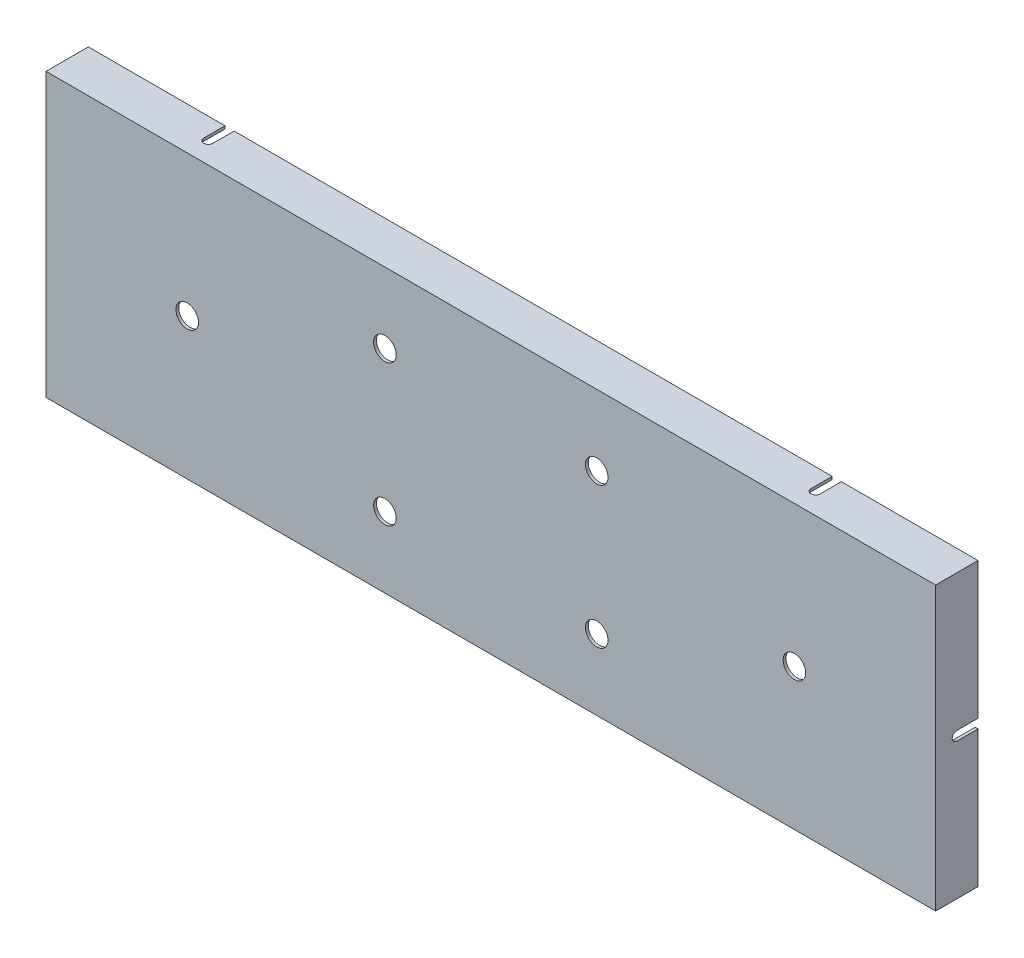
from build123d import *

# Parameters (mm, degrees)
SKETCH_1_W          = 630
SKETCH_1_H          = 200
EXTRUDE_1_DEPTH     = 30
SHELL_2_T           = -2
CUT_EXTRUDE_1_REACH = 663.665
SKETCH_4_R          = 8
CUT_EXTRUDE_2_DEPTH = 662.664567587
CUT_EXTRUDE_3_DEPTH = 662.664567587


with BuildPart() as part:
    # Sketch 1 → Extrude 1 (new body)
    with BuildSketch(Plane.XY):
        with Locations((315, -100)):
            Rectangle(SKETCH_1_W, SKETCH_1_H)
    extrude(amount=EXTRUDE_1_DEPTH)

    # Shell 2
    shell_2_openings = [part.faces().sort_by_distance(p)[0] for p in [
        (315, -100, 0),
    ]]
    offset(amount=SHELL_2_T, openings=shell_2_openings, kind=Kind.INTERSECTION)

    # Sketch 4 → Cut-Extrude 1 (cut, up to next)
    with BuildSketch(Plane.XY.offset(30), mode=Mode.PRIVATE) as cut_extrude_1_sk1:
        with Locations((530, -100)):
            Circle(SKETCH_4_R)
    cut_extrude_1_tool1 = extrude(cut_extrude_1_sk1.sketch, amount=-CUT_EXTRUDE_1_REACH, mode=Mode.PRIVATE) & part.part
    # Sketch 4 → Cut-Extrude 1 (cut, up to next)
    with BuildSketch(Plane.XY.offset(30), mode=Mode.PRIVATE) as cut_extrude_1_sk2:
        with Locations((100, -100)):
            Circle(SKETCH_4_R)
    cut_extrude_1_tool2 = extrude(cut_extrude_1_sk2.sketch, amount=-CUT_EXTRUDE_1_REACH, mode=Mode.PRIVATE) & part.part
    # Sketch 4 → Cut-Extrude 1 (cut, up to next)
    with BuildSketch(Plane.XY.offset(30), mode=Mode.PRIVATE) as cut_extrude_1_sk3:
        with Locations((240, -50)):
            Circle(SKETCH_4_R)
    cut_extrude_1_tool3 = extrude(cut_extrude_1_sk3.sketch, amount=-CUT_EXTRUDE_1_REACH, mode=Mode.PRIVATE) & part.part
    # Sketch 4 → Cut-Extrude 1 (cut, up to next)
    with BuildSketch(Plane.XY.offset(30), mode=Mode.PRIVATE) as cut_extrude_1_sk4:
        with Locations((390, -50)):
            Circle(SKETCH_4_R)
    cut_extrude_1_tool4 = extrude(cut_extrude_1_sk4.sketch, amount=-CUT_EXTRUDE_1_REACH, mode=Mode.PRIVATE) & part.part
    # Sketch 4 → Cut-Extrude 1 (cut, up to next)
    with BuildSketch(Plane.XY.offset(30), mode=Mode.PRIVATE) as cut_extrude_1_sk5:
        with Locations((240, -150)):
            Circle(SKETCH_4_R)
    cut_extrude_1_tool5 = extrude(cut_extrude_1_sk5.sketch, amount=-CUT_EXTRUDE_1_REACH, mode=Mode.PRIVATE) & part.part
    # Sketch 4 → Cut-Extrude 1 (cut, up to next)
    with BuildSketch(Plane.XY.offset(30), mode=Mode.PRIVATE) as cut_extrude_1_sk6:
        with Locations((390, -150)):
            Circle(SKETCH_4_R)
    cut_extrude_1_tool6 = extrude(cut_extrude_1_sk6.sketch, amount=-CUT_EXTRUDE_1_REACH, mode=Mode.PRIVATE) & part.part
    add(cut_extrude_1_tool1.solids().sort_by_distance((530, -100, 30))[0], mode=Mode.SUBTRACT)
    add(cut_extrude_1_tool2.solids().sort_by_distance((100, -100, 30))[0], mode=Mode.SUBTRACT)
    add(cut_extrude_1_tool3.solids().sort_by_distance((240, -50, 30))[0], mode=Mode.SUBTRACT)
    add(cut_extrude_1_tool4.solids().sort_by_distance((390, -50, 30))[0], mode=Mode.SUBTRACT)
    add(cut_extrude_1_tool5.solids().sort_by_distance((240, -150, 30))[0], mode=Mode.SUBTRACT)
    add(cut_extrude_1_tool6.solids().sort_by_distance((390, -150, 30))[0], mode=Mode.SUBTRACT)

    # Sketch 5 → Cut-Extrude 2 (cut, through all)
    with BuildSketch(Plane(origin=(0, 0, 0), x_dir=(1, 0, 0), z_dir=(0, 1, 0))):
        with BuildLine():
            Line((103.25, 0), (103.25, -15))
            ThreePointArc((103.25, -15), (100, -18.25), (96.75, -15))
            Line((96.75, -15), (96.75, 0))
            ThreePointArc((96.75, 0), (100, 3.25), (103.25, 0))
        make_face()
        with BuildLine():
            Line((533.25, 0), (533.25, -15))
            ThreePointArc((533.25, -15), (530, -18.25), (526.75, -15))
            Line((526.75, -15), (526.75, 0))
            ThreePointArc((526.75, 0), (530, 3.25), (533.25, 0))
        make_face()
    extrude(amount=-CUT_EXTRUDE_2_DEPTH, mode=Mode.SUBTRACT)

    # Sketch 6 → Cut-Extrude 3 (cut, through all)
    with BuildSketch(Plane.ZY):
        with BuildLine():
            Line((0, -96.75), (15, -96.75))
            ThreePointArc((15, -96.75), (18.25, -100), (15, -103.25))
            Line((15, -103.25), (0, -103.25))
            ThreePointArc((0, -103.25), (-3.25, -100), (0, -96.75))
        make_face()
    extrude(amount=-CUT_EXTRUDE_3_DEPTH, mode=Mode.SUBTRACT)


solid = part.part
